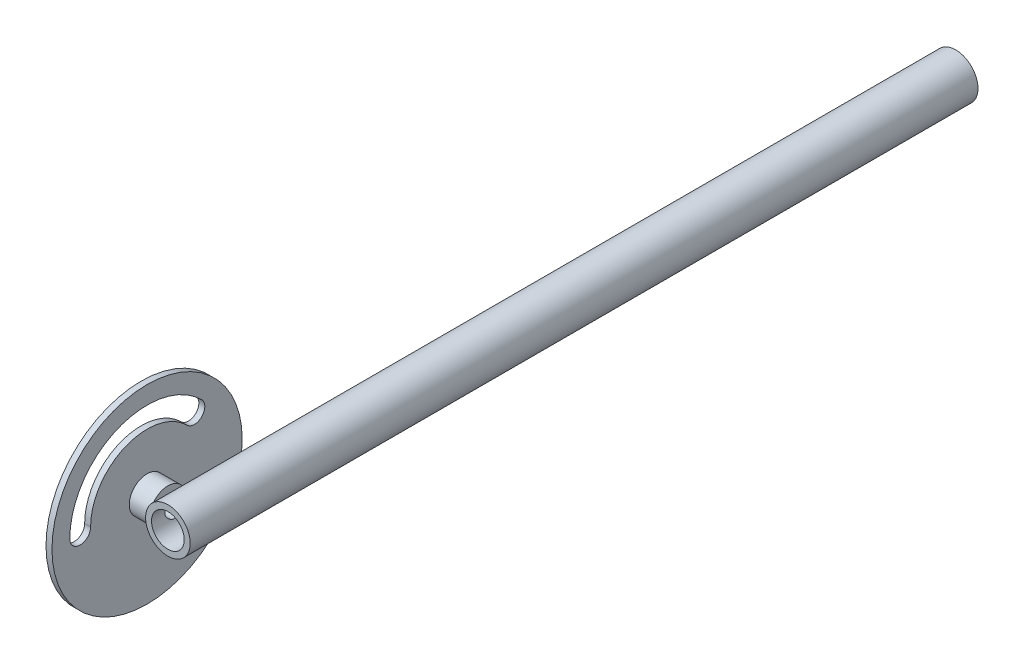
from build123d import *

# Parameters (mm, degrees)
ESQUISSE1_W                         = 2
ESQUISSE1_H                         = 32
ENL_V_MAT_EXTRU_1_DEPTH             = 51.487622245
ESQUISSE3_R                         = 6
BOSS_EXTRU_1_DEPTH                  = 7
ESQUISSE4_W                         = 7.5
ESQUISSE4_H                         = 265
DIAM_TRE_DU_PER_AGE_11_0_11_1_D     = 11
DIAM_TRE_DU_PER_AGE_11_0_11_1_DEPTH = 290
DIAM_TRE_DU_PER_AGE_5_0_5_1_REACH   = 269.958
DIAM_TRE_DU_PER_AGE_5_0_5_1_BORE_R  = 2.5


with BuildPart() as part:
    # Esquisse1 → R_volution1 (revolve)
    with BuildSketch(Plane.XY.offset(-7), mode=Mode.PRIVATE) as r_volution1_sk:
        with Locations((-15, 16)):
            Rectangle(ESQUISSE1_W, ESQUISSE1_H)
    revolve(r_volution1_sk.sketch.rotate(Axis((-16, 0, -7), (1, 0, 0)), 270), axis=Axis((-16, 0, -7), (1, 0, 0)))

    # Esquisse2 → Enl_v. mat.-Extru.1 (cut, through all)
    with BuildSketch(Plane(origin=(-14, 0, 0), x_dir=(0, 0, -1), z_dir=(1, 0, 0))):
        with BuildLine():
            ThreePointArc((25.384776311, 18.384776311), (-2.949769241, 24.020867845), (-19, 0))
            ThreePointArc((-19, 0), (-15.5, -3.5), (-12, 0))
            ThreePointArc((-12, 0), (-0.270985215, 17.553711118), (20.435028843, 13.435028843))
            ThreePointArc((20.435028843, 13.435028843), (25.384776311, 13.435028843), (25.384776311, 18.384776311))
        make_face()
    extrude(amount=-ENL_V_MAT_EXTRU_1_DEPTH, mode=Mode.SUBTRACT)

    # Esquisse3 → Boss.-Extru.1 (add)
    with BuildSketch(Plane(origin=(-14, 0, 0), x_dir=(0, 0, -1), z_dir=(1, 0, 0))):
        with Locations((7, 0)):
            Circle(ESQUISSE3_R)
    extrude(amount=BOSS_EXTRU_1_DEPTH)

    # Esquisse4 → R_volution2 (revolve)
    with BuildSketch(Plane(origin=(0, 0, 0), x_dir=(1, 0, 0), z_dir=(0, 1, 0))):
        with Locations((3.75, 132.5)):
            Rectangle(ESQUISSE4_W, ESQUISSE4_H)
    revolve(axis=Axis((0, 0, -265), (0, 0, 1)))

    # Diam_tre du per_age _11.0 _11_1
    with Locations(Plane(origin=(0, 0, -265), x_dir=(-1, 0, 0), z_dir=(0, 0, -1))):
        with Locations((0, 0)):
            Hole(DIAM_TRE_DU_PER_AGE_11_0_11_1_D / 2, depth=DIAM_TRE_DU_PER_AGE_11_0_11_1_DEPTH)

    # Diam_tre du per_age _5.0 _5_1 bore → Diam_tre du per_age _5.0 _5_1 (cut, up to next)
    with BuildSketch(Plane.ZY.offset(16), mode=Mode.PRIVATE) as diam_tre_du_per_age_5_0_5_1_sk1:
        with Locations((-7, 0)):
            Circle(DIAM_TRE_DU_PER_AGE_5_0_5_1_BORE_R)
    diam_tre_du_per_age_5_0_5_1_tool1 = extrude(diam_tre_du_per_age_5_0_5_1_sk1.sketch, amount=-DIAM_TRE_DU_PER_AGE_5_0_5_1_REACH, mode=Mode.PRIVATE) & part.part
    add(diam_tre_du_per_age_5_0_5_1_tool1.solids().sort_by_distance((-16, 0, -7))[0], mode=Mode.SUBTRACT)


solid = part.part
